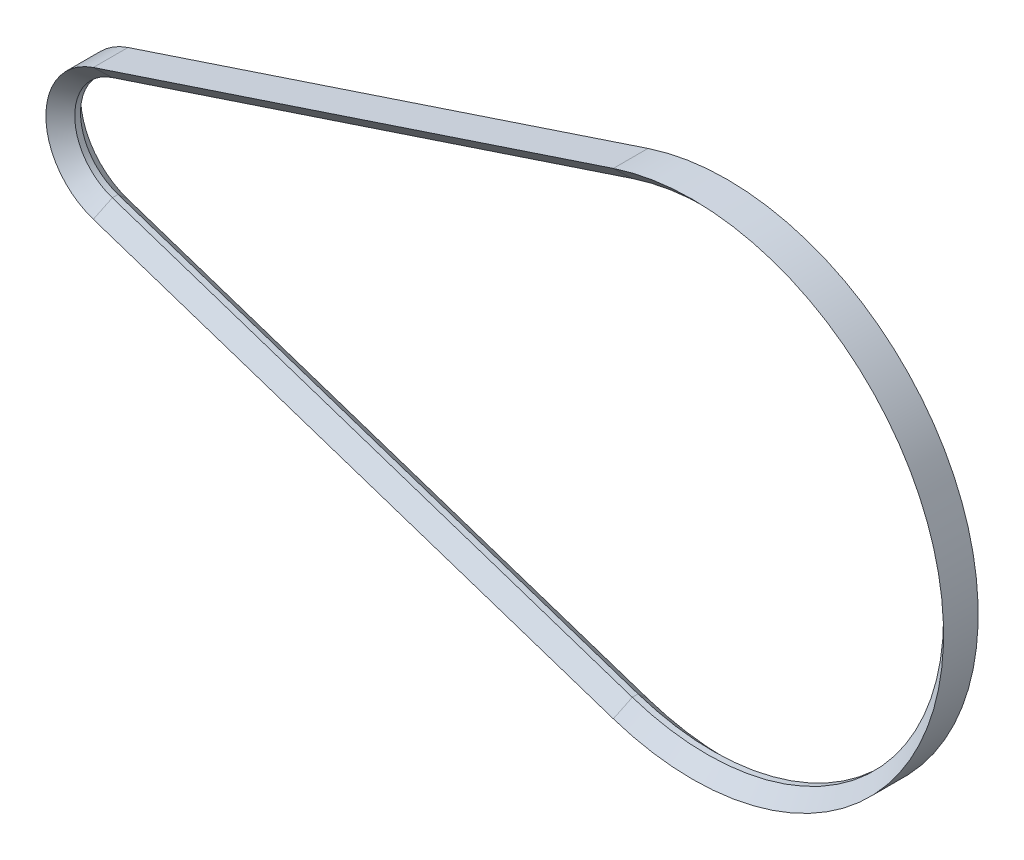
from build123d import *


with BuildPart() as part:
    # Balayage1: sweep along a path in Esquisse1
    with BuildLine(Plane.XY) as balayage1_path:
        Line((86.6125, 40.336396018), (-3.465, 10.440008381))
        ThreePointArc((-3.465, 10.440008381), (-11, 0), (-3.465, -10.440008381))
        Line((-3.465, -10.440008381), (86.6125, -40.336396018))
        ThreePointArc((86.6125, -40.336396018), (142.5, 0), (86.6125, 40.336396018))
    # Esquisse2 → Balayage1 (sweep)
    with BuildSketch(Plane(origin=(0, 0, 0), x_dir=(1, 0, 0), z_dir=(0, 1, 0))):
        Polygon((-12, -3), (-12, 3), (-9.5, 0.5), (-9.5, -0.5), align=None)
    sweep(path=balayage1_path.line)


solid = part.part
